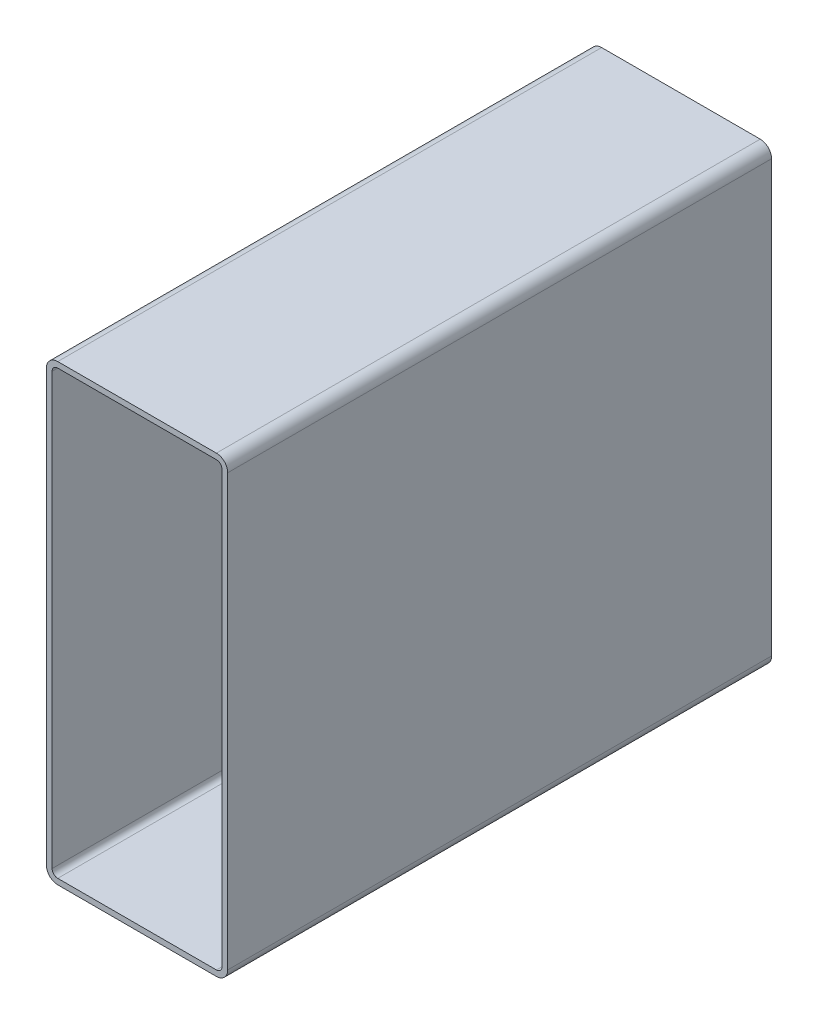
ISO-10303-21;
HEADER;
FILE_DESCRIPTION(('STEP AP214'),'2;1');
FILE_NAME('part.step','',(''),(''),'','','');
FILE_SCHEMA(('AUTOMOTIVE_DESIGN { 1 0 10303 214 1 1 1 1 }'));
ENDSEC;
DATA;
#1=APPLICATION_CONTEXT('core data for automotive mechanical design processes');
#2=APPLICATION_PROTOCOL_DEFINITION('international standard','automotive_design',2000,#1);
#3=PRODUCT_CONTEXT('',#1,'mechanical');
#4=PRODUCT('Part','Part','',(#3));
#5=PRODUCT_RELATED_PRODUCT_CATEGORY('part','',(#4));
#6=PRODUCT_DEFINITION_FORMATION('','',#4);
#7=PRODUCT_DEFINITION_CONTEXT('part definition',#1,'design');
#8=PRODUCT_DEFINITION('design','',#6,#7);
#9=PRODUCT_DEFINITION_SHAPE('','',#8);
#10=(LENGTH_UNIT() NAMED_UNIT(*) SI_UNIT(.MILLI.,.METRE.));
#11=(NAMED_UNIT(*) PLANE_ANGLE_UNIT() SI_UNIT($,.RADIAN.));
#12=(NAMED_UNIT(*) SI_UNIT($,.STERADIAN.) SOLID_ANGLE_UNIT());
#13=UNCERTAINTY_MEASURE_WITH_UNIT(LENGTH_MEASURE(1.E-05),#10,'distance_accuracy_value','');
#14=(GEOMETRIC_REPRESENTATION_CONTEXT(3) GLOBAL_UNCERTAINTY_ASSIGNED_CONTEXT((#13)) GLOBAL_UNIT_ASSIGNED_CONTEXT((#10,
#11,#12)) REPRESENTATION_CONTEXT('',''));
#15=CARTESIAN_POINT('',(0.,0.,0.));
#16=DIRECTION('',(0.,0.,1.));
#17=DIRECTION('',(1.,0.,0.));
#18=AXIS2_PLACEMENT_3D('',#15,#16,#17);
#19=CARTESIAN_POINT('',(96.9251778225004,8.27031383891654,304.8));
#20=DIRECTION('',(0.,0.,1.));
#21=DIRECTION('',(1.,0.,0.));
#22=AXIS2_PLACEMENT_3D('',#19,#20,#21);
#23=PLANE('',#22);
#24=CARTESIAN_POINT('',(96.9251778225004,8.27031383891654,304.8));
#25=DIRECTION('',(0.,0.,1.));
#26=DIRECTION('',(1.,0.,0.));
#27=AXIS2_PLACEMENT_3D('',#24,#25,#26);
#28=CIRCLE('',#27,6.35);
#29=CARTESIAN_POINT('',(96.9251778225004,1.92031383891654,304.8));
#30=VERTEX_POINT('',#29);
#31=CARTESIAN_POINT('',(103.2751778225,8.27031383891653,304.8));
#32=VERTEX_POINT('',#31);
#33=EDGE_CURVE('E211',#30,#32,#28,.T.);
#34=ORIENTED_EDGE('',*,*,#33,.T.);
#35=DIRECTION('',(0.,1.,0.));
#36=VECTOR('',#35,1.);
#37=CARTESIAN_POINT('',(103.2751778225,249.570313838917,304.8));
#38=LINE('',#37,#36);
#39=CARTESIAN_POINT('',(103.2751778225,249.570313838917,304.8));
#40=VERTEX_POINT('',#39);
#41=EDGE_CURVE('E214',#32,#40,#38,.T.);
#42=ORIENTED_EDGE('',*,*,#41,.T.);
#43=CARTESIAN_POINT('',(96.9251778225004,249.570313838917,304.8));
#44=DIRECTION('',(0.,0.,1.));
#45=DIRECTION('',(1.,0.,0.));
#46=AXIS2_PLACEMENT_3D('',#43,#44,#45);
#47=CIRCLE('',#46,6.35000000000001);
#48=CARTESIAN_POINT('',(96.9251778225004,255.920313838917,304.8));
#49=VERTEX_POINT('',#48);
#50=EDGE_CURVE('E217',#40,#49,#47,.T.);
#51=ORIENTED_EDGE('',*,*,#50,.T.);
#52=DIRECTION('',(-1.,0.,0.));
#53=VECTOR('',#52,1.);
#54=CARTESIAN_POINT('',(8.02517782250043,255.920313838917,304.8));
#55=LINE('',#54,#53);
#56=CARTESIAN_POINT('',(8.02517782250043,255.920313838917,304.8));
#57=VERTEX_POINT('',#56);
#58=EDGE_CURVE('E219',#49,#57,#55,.T.);
#59=ORIENTED_EDGE('',*,*,#58,.T.);
#60=CARTESIAN_POINT('',(8.02517782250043,249.570313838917,304.8));
#61=DIRECTION('',(0.,0.,1.));
#62=DIRECTION('',(1.,0.,0.));
#63=AXIS2_PLACEMENT_3D('',#60,#61,#62);
#64=CIRCLE('',#63,6.35000000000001);
#65=CARTESIAN_POINT('',(1.67517782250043,249.570313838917,304.8));
#66=VERTEX_POINT('',#65);
#67=EDGE_CURVE('E221',#57,#66,#64,.T.);
#68=ORIENTED_EDGE('',*,*,#67,.T.);
#69=DIRECTION('',(0.,-1.,0.));
#70=VECTOR('',#69,1.);
#71=CARTESIAN_POINT('',(1.67517782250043,8.27031383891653,304.8));
#72=LINE('',#71,#70);
#73=CARTESIAN_POINT('',(1.67517782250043,8.27031383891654,304.8));
#74=VERTEX_POINT('',#73);
#75=EDGE_CURVE('E223',#66,#74,#72,.T.);
#76=ORIENTED_EDGE('',*,*,#75,.T.);
#77=CARTESIAN_POINT('',(8.02517782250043,8.27031383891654,304.8));
#78=DIRECTION('',(0.,0.,1.));
#79=DIRECTION('',(1.,0.,0.));
#80=AXIS2_PLACEMENT_3D('',#77,#78,#79);
#81=CIRCLE('',#80,6.35);
#82=CARTESIAN_POINT('',(8.02517782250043,1.92031383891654,304.8));
#83=VERTEX_POINT('',#82);
#84=EDGE_CURVE('E225',#74,#83,#81,.T.);
#85=ORIENTED_EDGE('',*,*,#84,.T.);
#86=DIRECTION('',(1.,0.,0.));
#87=VECTOR('',#86,1.);
#88=CARTESIAN_POINT('',(96.9251778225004,1.92031383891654,304.8));
#89=LINE('',#88,#87);
#90=EDGE_CURVE('E227',#83,#30,#89,.T.);
#91=ORIENTED_EDGE('',*,*,#90,.T.);
#92=EDGE_LOOP('',(#34,#42,#51,#59,#68,#76,#85,#91));
#93=FACE_BOUND('',#92,.T.);
#94=DIRECTION('',(0.,-1.,0.));
#95=VECTOR('',#94,1.);
#96=CARTESIAN_POINT('',(4.85017782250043,8.27031383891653,304.8));
#97=LINE('',#96,#95);
#98=CARTESIAN_POINT('',(4.85017782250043,249.570313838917,304.8));
#99=VERTEX_POINT('',#98);
#100=CARTESIAN_POINT('',(4.85017782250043,8.27031383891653,304.8));
#101=VERTEX_POINT('',#100);
#102=EDGE_CURVE('E154',#99,#101,#97,.T.);
#103=ORIENTED_EDGE('',*,*,#102,.F.);
#104=CARTESIAN_POINT('',(8.02517782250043,249.570313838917,304.8));
#105=DIRECTION('',(0.,0.,1.));
#106=DIRECTION('',(1.,0.,0.));
#107=AXIS2_PLACEMENT_3D('',#104,#105,#106);
#108=CIRCLE('',#107,3.17499999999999);
#109=CARTESIAN_POINT('',(8.02517782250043,252.745313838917,304.8));
#110=VERTEX_POINT('',#109);
#111=EDGE_CURVE('E146',#110,#99,#108,.T.);
#112=ORIENTED_EDGE('',*,*,#111,.F.);
#113=DIRECTION('',(-1.,0.,0.));
#114=VECTOR('',#113,1.);
#115=CARTESIAN_POINT('',(8.02517782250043,252.745313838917,304.8));
#116=LINE('',#115,#114);
#117=CARTESIAN_POINT('',(96.9251778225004,252.745313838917,304.8));
#118=VERTEX_POINT('',#117);
#119=EDGE_CURVE('E179',#118,#110,#116,.T.);
#120=ORIENTED_EDGE('',*,*,#119,.F.);
#121=CARTESIAN_POINT('',(96.9251778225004,249.570313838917,304.8));
#122=DIRECTION('',(0.,0.,1.));
#123=DIRECTION('',(1.,0.,0.));
#124=AXIS2_PLACEMENT_3D('',#121,#122,#123);
#125=CIRCLE('',#124,3.17499999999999);
#126=CARTESIAN_POINT('',(100.1001778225,249.570313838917,304.8));
#127=VERTEX_POINT('',#126);
#128=EDGE_CURVE('E177',#127,#118,#125,.T.);
#129=ORIENTED_EDGE('',*,*,#128,.F.);
#130=DIRECTION('',(0.,1.,0.));
#131=VECTOR('',#130,1.);
#132=CARTESIAN_POINT('',(100.1001778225,249.570313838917,304.8));
#133=LINE('',#132,#131);
#134=CARTESIAN_POINT('',(100.1001778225,8.27031383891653,304.8));
#135=VERTEX_POINT('',#134);
#136=EDGE_CURVE('E175',#135,#127,#133,.T.);
#137=ORIENTED_EDGE('',*,*,#136,.F.);
#138=CARTESIAN_POINT('',(96.9251778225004,8.27031383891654,304.8));
#139=DIRECTION('',(0.,0.,1.));
#140=DIRECTION('',(1.,0.,0.));
#141=AXIS2_PLACEMENT_3D('',#138,#139,#140);
#142=CIRCLE('',#141,3.175);
#143=CARTESIAN_POINT('',(96.9251778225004,5.09531383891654,304.8));
#144=VERTEX_POINT('',#143);
#145=EDGE_CURVE('E173',#144,#135,#142,.T.);
#146=ORIENTED_EDGE('',*,*,#145,.F.);
#147=DIRECTION('',(1.,0.,0.));
#148=VECTOR('',#147,1.);
#149=CARTESIAN_POINT('',(96.9251778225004,5.09531383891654,304.8));
#150=LINE('',#149,#148);
#151=CARTESIAN_POINT('',(8.02517782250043,5.09531383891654,304.8));
#152=VERTEX_POINT('',#151);
#153=EDGE_CURVE('E169',#152,#144,#150,.T.);
#154=ORIENTED_EDGE('',*,*,#153,.F.);
#155=CARTESIAN_POINT('',(8.02517782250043,8.27031383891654,304.8));
#156=DIRECTION('',(0.,0.,1.));
#157=DIRECTION('',(1.,0.,0.));
#158=AXIS2_PLACEMENT_3D('',#155,#156,#157);
#159=CIRCLE('',#158,3.175);
#160=EDGE_CURVE('E167',#101,#152,#159,.T.);
#161=ORIENTED_EDGE('',*,*,#160,.F.);
#162=EDGE_LOOP('',(#103,#112,#120,#129,#137,#146,#154,#161));
#163=FACE_BOUND('',#162,.T.);
#164=ADVANCED_FACE('F33',(#93,#163),#23,.T.);
#165=CARTESIAN_POINT('',(96.9251778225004,8.27031383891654,0.));
#166=DIRECTION('',(0.,0.,1.));
#167=DIRECTION('',(1.,0.,0.));
#168=AXIS2_PLACEMENT_3D('',#165,#166,#167);
#169=PLANE('',#168);
#170=CARTESIAN_POINT('',(96.9251778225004,8.27031383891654,0.));
#171=DIRECTION('',(0.,0.,1.));
#172=DIRECTION('',(1.,0.,0.));
#173=AXIS2_PLACEMENT_3D('',#170,#171,#172);
#174=CIRCLE('',#173,6.35);
#175=CARTESIAN_POINT('',(96.9251778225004,1.92031383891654,0.));
#176=VERTEX_POINT('',#175);
#177=CARTESIAN_POINT('',(103.2751778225,8.27031383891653,0.));
#178=VERTEX_POINT('',#177);
#179=EDGE_CURVE('E162',#176,#178,#174,.T.);
#180=ORIENTED_EDGE('',*,*,#179,.F.);
#181=DIRECTION('',(1.,0.,0.));
#182=VECTOR('',#181,1.);
#183=CARTESIAN_POINT('',(96.9251778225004,1.92031383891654,0.));
#184=LINE('',#183,#182);
#185=CARTESIAN_POINT('',(8.02517782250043,1.92031383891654,0.));
#186=VERTEX_POINT('',#185);
#187=EDGE_CURVE('E215',#186,#176,#184,.T.);
#188=ORIENTED_EDGE('',*,*,#187,.F.);
#189=CARTESIAN_POINT('',(8.02517782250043,8.27031383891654,0.));
#190=DIRECTION('',(0.,0.,1.));
#191=DIRECTION('',(1.,0.,0.));
#192=AXIS2_PLACEMENT_3D('',#189,#190,#191);
#193=CIRCLE('',#192,6.35);
#194=CARTESIAN_POINT('',(1.67517782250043,8.27031383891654,0.));
#195=VERTEX_POINT('',#194);
#196=EDGE_CURVE('E242',#195,#186,#193,.T.);
#197=ORIENTED_EDGE('',*,*,#196,.F.);
#198=DIRECTION('',(0.,-1.,0.));
#199=VECTOR('',#198,1.);
#200=CARTESIAN_POINT('',(1.67517782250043,8.27031383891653,0.));
#201=LINE('',#200,#199);
#202=CARTESIAN_POINT('',(1.67517782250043,249.570313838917,0.));
#203=VERTEX_POINT('',#202);
#204=EDGE_CURVE('E240',#203,#195,#201,.T.);
#205=ORIENTED_EDGE('',*,*,#204,.F.);
#206=CARTESIAN_POINT('',(8.02517782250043,249.570313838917,0.));
#207=DIRECTION('',(0.,0.,1.));
#208=DIRECTION('',(1.,0.,0.));
#209=AXIS2_PLACEMENT_3D('',#206,#207,#208);
#210=CIRCLE('',#209,6.35000000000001);
#211=CARTESIAN_POINT('',(8.02517782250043,255.920313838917,0.));
#212=VERTEX_POINT('',#211);
#213=EDGE_CURVE('E238',#212,#203,#210,.T.);
#214=ORIENTED_EDGE('',*,*,#213,.F.);
#215=DIRECTION('',(-1.,0.,0.));
#216=VECTOR('',#215,1.);
#217=CARTESIAN_POINT('',(8.02517782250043,255.920313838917,0.));
#218=LINE('',#217,#216);
#219=CARTESIAN_POINT('',(96.9251778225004,255.920313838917,0.));
#220=VERTEX_POINT('',#219);
#221=EDGE_CURVE('E236',#220,#212,#218,.T.);
#222=ORIENTED_EDGE('',*,*,#221,.F.);
#223=CARTESIAN_POINT('',(96.9251778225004,249.570313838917,0.));
#224=DIRECTION('',(0.,0.,1.));
#225=DIRECTION('',(1.,0.,0.));
#226=AXIS2_PLACEMENT_3D('',#223,#224,#225);
#227=CIRCLE('',#226,6.35000000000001);
#228=CARTESIAN_POINT('',(103.2751778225,249.570313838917,0.));
#229=VERTEX_POINT('',#228);
#230=EDGE_CURVE('E234',#229,#220,#227,.T.);
#231=ORIENTED_EDGE('',*,*,#230,.F.);
#232=DIRECTION('',(0.,1.,0.));
#233=VECTOR('',#232,1.);
#234=CARTESIAN_POINT('',(103.2751778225,249.570313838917,0.));
#235=LINE('',#234,#233);
#236=EDGE_CURVE('E232',#178,#229,#235,.T.);
#237=ORIENTED_EDGE('',*,*,#236,.F.);
#238=EDGE_LOOP('',(#180,#188,#197,#205,#214,#222,#231,#237));
#239=FACE_BOUND('',#238,.T.);
#240=CARTESIAN_POINT('',(8.02517782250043,249.570313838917,0.));
#241=DIRECTION('',(0.,0.,1.));
#242=DIRECTION('',(1.,0.,0.));
#243=AXIS2_PLACEMENT_3D('',#240,#241,#242);
#244=CIRCLE('',#243,3.17499999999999);
#245=CARTESIAN_POINT('',(8.02517782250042,252.745313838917,0.));
#246=VERTEX_POINT('',#245);
#247=CARTESIAN_POINT('',(4.85017782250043,249.570313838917,0.));
#248=VERTEX_POINT('',#247);
#249=EDGE_CURVE('E56',#246,#248,#244,.T.);
#250=ORIENTED_EDGE('',*,*,#249,.T.);
#251=DIRECTION('',(0.,-1.,0.));
#252=VECTOR('',#251,1.);
#253=CARTESIAN_POINT('',(4.85017782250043,8.27031383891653,0.));
#254=LINE('',#253,#252);
#255=CARTESIAN_POINT('',(4.85017782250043,8.27031383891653,0.));
#256=VERTEX_POINT('',#255);
#257=EDGE_CURVE('E161',#248,#256,#254,.T.);
#258=ORIENTED_EDGE('',*,*,#257,.T.);
#259=CARTESIAN_POINT('',(8.02517782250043,8.27031383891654,0.));
#260=DIRECTION('',(0.,0.,1.));
#261=DIRECTION('',(1.,0.,0.));
#262=AXIS2_PLACEMENT_3D('',#259,#260,#261);
#263=CIRCLE('',#262,3.175);
#264=CARTESIAN_POINT('',(8.02517782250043,5.09531383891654,0.));
#265=VERTEX_POINT('',#264);
#266=EDGE_CURVE('E183',#256,#265,#263,.T.);
#267=ORIENTED_EDGE('',*,*,#266,.T.);
#268=DIRECTION('',(1.,0.,0.));
#269=VECTOR('',#268,1.);
#270=CARTESIAN_POINT('',(96.9251778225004,5.09531383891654,0.));
#271=LINE('',#270,#269);
#272=CARTESIAN_POINT('',(96.9251778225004,5.09531383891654,0.));
#273=VERTEX_POINT('',#272);
#274=EDGE_CURVE('E186',#265,#273,#271,.T.);
#275=ORIENTED_EDGE('',*,*,#274,.T.);
#276=CARTESIAN_POINT('',(96.9251778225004,8.27031383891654,0.));
#277=DIRECTION('',(0.,0.,1.));
#278=DIRECTION('',(1.,0.,0.));
#279=AXIS2_PLACEMENT_3D('',#276,#277,#278);
#280=CIRCLE('',#279,3.175);
#281=CARTESIAN_POINT('',(100.1001778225,8.27031383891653,0.));
#282=VERTEX_POINT('',#281);
#283=EDGE_CURVE('E189',#273,#282,#280,.T.);
#284=ORIENTED_EDGE('',*,*,#283,.T.);
#285=DIRECTION('',(0.,1.,0.));
#286=VECTOR('',#285,1.);
#287=CARTESIAN_POINT('',(100.1001778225,249.570313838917,0.));
#288=LINE('',#287,#286);
#289=CARTESIAN_POINT('',(100.1001778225,249.570313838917,0.));
#290=VERTEX_POINT('',#289);
#291=EDGE_CURVE('E192',#282,#290,#288,.T.);
#292=ORIENTED_EDGE('',*,*,#291,.T.);
#293=CARTESIAN_POINT('',(96.9251778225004,249.570313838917,0.));
#294=DIRECTION('',(0.,0.,1.));
#295=DIRECTION('',(1.,0.,0.));
#296=AXIS2_PLACEMENT_3D('',#293,#294,#295);
#297=CIRCLE('',#296,3.17499999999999);
#298=CARTESIAN_POINT('',(96.9251778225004,252.745313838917,0.));
#299=VERTEX_POINT('',#298);
#300=EDGE_CURVE('E195',#290,#299,#297,.T.);
#301=ORIENTED_EDGE('',*,*,#300,.T.);
#302=DIRECTION('',(-1.,0.,0.));
#303=VECTOR('',#302,1.);
#304=CARTESIAN_POINT('',(8.02517782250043,252.745313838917,0.));
#305=LINE('',#304,#303);
#306=EDGE_CURVE('E155',#299,#246,#305,.T.);
#307=ORIENTED_EDGE('',*,*,#306,.T.);
#308=EDGE_LOOP('',(#250,#258,#267,#275,#284,#292,#301,#307));
#309=FACE_BOUND('',#308,.T.);
#310=ADVANCED_FACE('F272',(#239,#309),#169,.F.);
#311=CARTESIAN_POINT('',(96.9251778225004,8.27031383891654,304.8));
#312=DIRECTION('',(0.,0.,-1.));
#313=DIRECTION('',(-1.,0.,0.));
#314=AXIS2_PLACEMENT_3D('',#311,#312,#313);
#315=CYLINDRICAL_SURFACE('',#314,6.35);
#316=ORIENTED_EDGE('',*,*,#179,.T.);
#317=DIRECTION('',(0.,0.,-1.));
#318=VECTOR('',#317,1.);
#319=CARTESIAN_POINT('',(103.2751778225,8.27031383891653,304.8));
#320=LINE('',#319,#318);
#321=EDGE_CURVE('E11',#32,#178,#320,.T.);
#322=ORIENTED_EDGE('',*,*,#321,.F.);
#323=ORIENTED_EDGE('',*,*,#33,.F.);
#324=DIRECTION('',(0.,0.,-1.));
#325=VECTOR('',#324,1.);
#326=CARTESIAN_POINT('',(96.9251778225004,1.92031383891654,304.8));
#327=LINE('',#326,#325);
#328=EDGE_CURVE('E229',#30,#176,#327,.T.);
#329=ORIENTED_EDGE('',*,*,#328,.T.);
#330=EDGE_LOOP('',(#316,#322,#323,#329));
#331=FACE_BOUND('',#330,.T.);
#332=ADVANCED_FACE('F35',(#331),#315,.T.);
#333=CARTESIAN_POINT('',(103.2751778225,249.570313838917,304.8));
#334=DIRECTION('',(-1.,0.,0.));
#335=DIRECTION('',(0.,0.,1.));
#336=AXIS2_PLACEMENT_3D('',#333,#334,#335);
#337=PLANE('',#336);
#338=ORIENTED_EDGE('',*,*,#236,.T.);
#339=DIRECTION('',(0.,0.,-1.));
#340=VECTOR('',#339,1.);
#341=CARTESIAN_POINT('',(103.2751778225,249.570313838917,304.8));
#342=LINE('',#341,#340);
#343=EDGE_CURVE('E41',#40,#229,#342,.T.);
#344=ORIENTED_EDGE('',*,*,#343,.F.);
#345=ORIENTED_EDGE('',*,*,#41,.F.);
#346=ORIENTED_EDGE('',*,*,#321,.T.);
#347=EDGE_LOOP('',(#338,#344,#345,#346));
#348=FACE_BOUND('',#347,.T.);
#349=ADVANCED_FACE('F289',(#348),#337,.F.);
#350=CARTESIAN_POINT('',(96.9251778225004,249.570313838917,304.8));
#351=DIRECTION('',(0.,0.,-1.));
#352=DIRECTION('',(-1.,0.,0.));
#353=AXIS2_PLACEMENT_3D('',#350,#351,#352);
#354=CYLINDRICAL_SURFACE('',#353,6.35000000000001);
#355=ORIENTED_EDGE('',*,*,#230,.T.);
#356=DIRECTION('',(0.,0.,-1.));
#357=VECTOR('',#356,1.);
#358=CARTESIAN_POINT('',(96.9251778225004,255.920313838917,304.8));
#359=LINE('',#358,#357);
#360=EDGE_CURVE('E259',#49,#220,#359,.T.);
#361=ORIENTED_EDGE('',*,*,#360,.F.);
#362=ORIENTED_EDGE('',*,*,#50,.F.);
#363=ORIENTED_EDGE('',*,*,#343,.T.);
#364=EDGE_LOOP('',(#355,#361,#362,#363));
#365=FACE_BOUND('',#364,.T.);
#366=ADVANCED_FACE('F266',(#365),#354,.T.);
#367=CARTESIAN_POINT('',(8.02517782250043,255.920313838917,304.8));
#368=DIRECTION('',(0.,-1.,0.));
#369=DIRECTION('',(0.,0.,-1.));
#370=AXIS2_PLACEMENT_3D('',#367,#368,#369);
#371=PLANE('',#370);
#372=ORIENTED_EDGE('',*,*,#221,.T.);
#373=DIRECTION('',(0.,0.,-1.));
#374=VECTOR('',#373,1.);
#375=CARTESIAN_POINT('',(8.02517782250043,255.920313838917,304.8));
#376=LINE('',#375,#374);
#377=EDGE_CURVE('E256',#57,#212,#376,.T.);
#378=ORIENTED_EDGE('',*,*,#377,.F.);
#379=ORIENTED_EDGE('',*,*,#58,.F.);
#380=ORIENTED_EDGE('',*,*,#360,.T.);
#381=EDGE_LOOP('',(#372,#378,#379,#380));
#382=FACE_BOUND('',#381,.T.);
#383=ADVANCED_FACE('F278',(#382),#371,.F.);
#384=CARTESIAN_POINT('',(8.02517782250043,249.570313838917,304.8));
#385=DIRECTION('',(0.,0.,-1.));
#386=DIRECTION('',(-1.,0.,0.));
#387=AXIS2_PLACEMENT_3D('',#384,#385,#386);
#388=CYLINDRICAL_SURFACE('',#387,6.35000000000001);
#389=ORIENTED_EDGE('',*,*,#213,.T.);
#390=DIRECTION('',(0.,0.,-1.));
#391=VECTOR('',#390,1.);
#392=CARTESIAN_POINT('',(1.67517782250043,249.570313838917,304.8));
#393=LINE('',#392,#391);
#394=EDGE_CURVE('E253',#66,#203,#393,.T.);
#395=ORIENTED_EDGE('',*,*,#394,.F.);
#396=ORIENTED_EDGE('',*,*,#67,.F.);
#397=ORIENTED_EDGE('',*,*,#377,.T.);
#398=EDGE_LOOP('',(#389,#395,#396,#397));
#399=FACE_BOUND('',#398,.T.);
#400=ADVANCED_FACE('F282',(#399),#388,.T.);
#401=CARTESIAN_POINT('',(1.67517782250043,8.27031383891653,304.8));
#402=DIRECTION('',(1.,0.,0.));
#403=DIRECTION('',(0.,0.,-1.));
#404=AXIS2_PLACEMENT_3D('',#401,#402,#403);
#405=PLANE('',#404);
#406=ORIENTED_EDGE('',*,*,#204,.T.);
#407=DIRECTION('',(0.,0.,-1.));
#408=VECTOR('',#407,1.);
#409=CARTESIAN_POINT('',(1.67517782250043,8.27031383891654,304.8));
#410=LINE('',#409,#408);
#411=EDGE_CURVE('E250',#74,#195,#410,.T.);
#412=ORIENTED_EDGE('',*,*,#411,.F.);
#413=ORIENTED_EDGE('',*,*,#75,.F.);
#414=ORIENTED_EDGE('',*,*,#394,.T.);
#415=EDGE_LOOP('',(#406,#412,#413,#414));
#416=FACE_BOUND('',#415,.T.);
#417=ADVANCED_FACE('F302',(#416),#405,.F.);
#418=CARTESIAN_POINT('',(8.02517782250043,8.27031383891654,304.8));
#419=DIRECTION('',(0.,0.,-1.));
#420=DIRECTION('',(-1.,0.,0.));
#421=AXIS2_PLACEMENT_3D('',#418,#419,#420);
#422=CYLINDRICAL_SURFACE('',#421,6.35);
#423=ORIENTED_EDGE('',*,*,#196,.T.);
#424=DIRECTION('',(0.,0.,-1.));
#425=VECTOR('',#424,1.);
#426=CARTESIAN_POINT('',(8.02517782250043,1.92031383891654,304.8));
#427=LINE('',#426,#425);
#428=EDGE_CURVE('E247',#83,#186,#427,.T.);
#429=ORIENTED_EDGE('',*,*,#428,.F.);
#430=ORIENTED_EDGE('',*,*,#84,.F.);
#431=ORIENTED_EDGE('',*,*,#411,.T.);
#432=EDGE_LOOP('',(#423,#429,#430,#431));
#433=FACE_BOUND('',#432,.T.);
#434=ADVANCED_FACE('F300',(#433),#422,.T.);
#435=CARTESIAN_POINT('',(96.9251778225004,1.92031383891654,304.8));
#436=DIRECTION('',(0.,1.,0.));
#437=DIRECTION('',(0.,0.,1.));
#438=AXIS2_PLACEMENT_3D('',#435,#436,#437);
#439=PLANE('',#438);
#440=ORIENTED_EDGE('',*,*,#187,.T.);
#441=ORIENTED_EDGE('',*,*,#328,.F.);
#442=ORIENTED_EDGE('',*,*,#90,.F.);
#443=ORIENTED_EDGE('',*,*,#428,.T.);
#444=EDGE_LOOP('',(#440,#441,#442,#443));
#445=FACE_BOUND('',#444,.T.);
#446=ADVANCED_FACE('F295',(#445),#439,.F.);
#447=CARTESIAN_POINT('',(8.02517782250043,249.570313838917,304.8));
#448=DIRECTION('',(0.,0.,-1.));
#449=DIRECTION('',(-1.,0.,0.));
#450=AXIS2_PLACEMENT_3D('',#447,#448,#449);
#451=CYLINDRICAL_SURFACE('',#450,3.17499999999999);
#452=ORIENTED_EDGE('',*,*,#249,.F.);
#453=DIRECTION('',(0.,0.,-1.));
#454=VECTOR('',#453,1.);
#455=CARTESIAN_POINT('',(8.02517782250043,252.745313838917,304.8));
#456=LINE('',#455,#454);
#457=EDGE_CURVE('E150',#110,#246,#456,.T.);
#458=ORIENTED_EDGE('',*,*,#457,.F.);
#459=ORIENTED_EDGE('',*,*,#111,.T.);
#460=DIRECTION('',(0.,0.,-1.));
#461=VECTOR('',#460,1.);
#462=CARTESIAN_POINT('',(4.85017782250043,249.570313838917,304.8));
#463=LINE('',#462,#461);
#464=EDGE_CURVE('E149',#99,#248,#463,.T.);
#465=ORIENTED_EDGE('',*,*,#464,.T.);
#466=EDGE_LOOP('',(#452,#458,#459,#465));
#467=FACE_BOUND('',#466,.T.);
#468=ADVANCED_FACE('F148',(#467),#451,.F.);
#469=CARTESIAN_POINT('',(4.85017782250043,8.27031383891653,304.8));
#470=DIRECTION('',(1.,0.,0.));
#471=DIRECTION('',(0.,0.,-1.));
#472=AXIS2_PLACEMENT_3D('',#469,#470,#471);
#473=PLANE('',#472);
#474=ORIENTED_EDGE('',*,*,#257,.F.);
#475=ORIENTED_EDGE('',*,*,#464,.F.);
#476=ORIENTED_EDGE('',*,*,#102,.T.);
#477=DIRECTION('',(0.,0.,-1.));
#478=VECTOR('',#477,1.);
#479=CARTESIAN_POINT('',(4.85017782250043,8.27031383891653,304.8));
#480=LINE('',#479,#478);
#481=EDGE_CURVE('E163',#101,#256,#480,.T.);
#482=ORIENTED_EDGE('',*,*,#481,.T.);
#483=EDGE_LOOP('',(#474,#475,#476,#482));
#484=FACE_BOUND('',#483,.T.);
#485=ADVANCED_FACE('F158',(#484),#473,.T.);
#486=CARTESIAN_POINT('',(8.02517782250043,8.27031383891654,304.8));
#487=DIRECTION('',(0.,0.,-1.));
#488=DIRECTION('',(-1.,0.,0.));
#489=AXIS2_PLACEMENT_3D('',#486,#487,#488);
#490=CYLINDRICAL_SURFACE('',#489,3.175);
#491=ORIENTED_EDGE('',*,*,#266,.F.);
#492=ORIENTED_EDGE('',*,*,#481,.F.);
#493=ORIENTED_EDGE('',*,*,#160,.T.);
#494=DIRECTION('',(0.,0.,-1.));
#495=VECTOR('',#494,1.);
#496=CARTESIAN_POINT('',(8.02517782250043,5.09531383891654,304.8));
#497=LINE('',#496,#495);
#498=EDGE_CURVE('E208',#152,#265,#497,.T.);
#499=ORIENTED_EDGE('',*,*,#498,.T.);
#500=EDGE_LOOP('',(#491,#492,#493,#499));
#501=FACE_BOUND('',#500,.T.);
#502=ADVANCED_FACE('F327',(#501),#490,.F.);
#503=CARTESIAN_POINT('',(96.9251778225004,5.09531383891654,304.8));
#504=DIRECTION('',(0.,1.,0.));
#505=DIRECTION('',(0.,0.,1.));
#506=AXIS2_PLACEMENT_3D('',#503,#504,#505);
#507=PLANE('',#506);
#508=ORIENTED_EDGE('',*,*,#274,.F.);
#509=ORIENTED_EDGE('',*,*,#498,.F.);
#510=ORIENTED_EDGE('',*,*,#153,.T.);
#511=DIRECTION('',(0.,0.,-1.));
#512=VECTOR('',#511,1.);
#513=CARTESIAN_POINT('',(96.9251778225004,5.09531383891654,304.8));
#514=LINE('',#513,#512);
#515=EDGE_CURVE('E206',#144,#273,#514,.T.);
#516=ORIENTED_EDGE('',*,*,#515,.T.);
#517=EDGE_LOOP('',(#508,#509,#510,#516));
#518=FACE_BOUND('',#517,.T.);
#519=ADVANCED_FACE('F331',(#518),#507,.T.);
#520=CARTESIAN_POINT('',(96.9251778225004,8.27031383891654,304.8));
#521=DIRECTION('',(0.,0.,-1.));
#522=DIRECTION('',(-1.,0.,0.));
#523=AXIS2_PLACEMENT_3D('',#520,#521,#522);
#524=CYLINDRICAL_SURFACE('',#523,3.175);
#525=ORIENTED_EDGE('',*,*,#283,.F.);
#526=ORIENTED_EDGE('',*,*,#515,.F.);
#527=ORIENTED_EDGE('',*,*,#145,.T.);
#528=DIRECTION('',(0.,0.,-1.));
#529=VECTOR('',#528,1.);
#530=CARTESIAN_POINT('',(100.1001778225,8.27031383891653,304.8));
#531=LINE('',#530,#529);
#532=EDGE_CURVE('E204',#135,#282,#531,.T.);
#533=ORIENTED_EDGE('',*,*,#532,.T.);
#534=EDGE_LOOP('',(#525,#526,#527,#533));
#535=FACE_BOUND('',#534,.T.);
#536=ADVANCED_FACE('F337',(#535),#524,.F.);
#537=CARTESIAN_POINT('',(100.1001778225,249.570313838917,304.8));
#538=DIRECTION('',(-1.,0.,0.));
#539=DIRECTION('',(0.,0.,1.));
#540=AXIS2_PLACEMENT_3D('',#537,#538,#539);
#541=PLANE('',#540);
#542=ORIENTED_EDGE('',*,*,#291,.F.);
#543=ORIENTED_EDGE('',*,*,#532,.F.);
#544=ORIENTED_EDGE('',*,*,#136,.T.);
#545=DIRECTION('',(0.,0.,-1.));
#546=VECTOR('',#545,1.);
#547=CARTESIAN_POINT('',(100.1001778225,249.570313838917,304.8));
#548=LINE('',#547,#546);
#549=EDGE_CURVE('E202',#127,#290,#548,.T.);
#550=ORIENTED_EDGE('',*,*,#549,.T.);
#551=EDGE_LOOP('',(#542,#543,#544,#550));
#552=FACE_BOUND('',#551,.T.);
#553=ADVANCED_FACE('F341',(#552),#541,.T.);
#554=CARTESIAN_POINT('',(96.9251778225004,249.570313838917,304.8));
#555=DIRECTION('',(0.,0.,-1.));
#556=DIRECTION('',(-1.,0.,0.));
#557=AXIS2_PLACEMENT_3D('',#554,#555,#556);
#558=CYLINDRICAL_SURFACE('',#557,3.17499999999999);
#559=ORIENTED_EDGE('',*,*,#300,.F.);
#560=ORIENTED_EDGE('',*,*,#549,.F.);
#561=ORIENTED_EDGE('',*,*,#128,.T.);
#562=DIRECTION('',(0.,0.,-1.));
#563=VECTOR('',#562,1.);
#564=CARTESIAN_POINT('',(96.9251778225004,252.745313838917,304.8));
#565=LINE('',#564,#563);
#566=EDGE_CURVE('E48',#118,#299,#565,.T.);
#567=ORIENTED_EDGE('',*,*,#566,.T.);
#568=EDGE_LOOP('',(#559,#560,#561,#567));
#569=FACE_BOUND('',#568,.T.);
#570=ADVANCED_FACE('F345',(#569),#558,.F.);
#571=CARTESIAN_POINT('',(8.02517782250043,252.745313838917,304.8));
#572=DIRECTION('',(0.,-1.,0.));
#573=DIRECTION('',(0.,0.,-1.));
#574=AXIS2_PLACEMENT_3D('',#571,#572,#573);
#575=PLANE('',#574);
#576=ORIENTED_EDGE('',*,*,#306,.F.);
#577=ORIENTED_EDGE('',*,*,#566,.F.);
#578=ORIENTED_EDGE('',*,*,#119,.T.);
#579=ORIENTED_EDGE('',*,*,#457,.T.);
#580=EDGE_LOOP('',(#576,#577,#578,#579));
#581=FACE_BOUND('',#580,.T.);
#582=ADVANCED_FACE('F349',(#581),#575,.T.);
#583=CLOSED_SHELL('',(#164,#310,#332,#349,#366,#383,#400,#417,#434,#446,#468,#485,#502,#519,
#536,#553,#570,#582));
#584=MANIFOLD_SOLID_BREP('B2',#583);
#585=ADVANCED_BREP_SHAPE_REPRESENTATION('',(#18,#584),#14);
#586=SHAPE_DEFINITION_REPRESENTATION(#9,#585);
ENDSEC;
END-ISO-10303-21;
